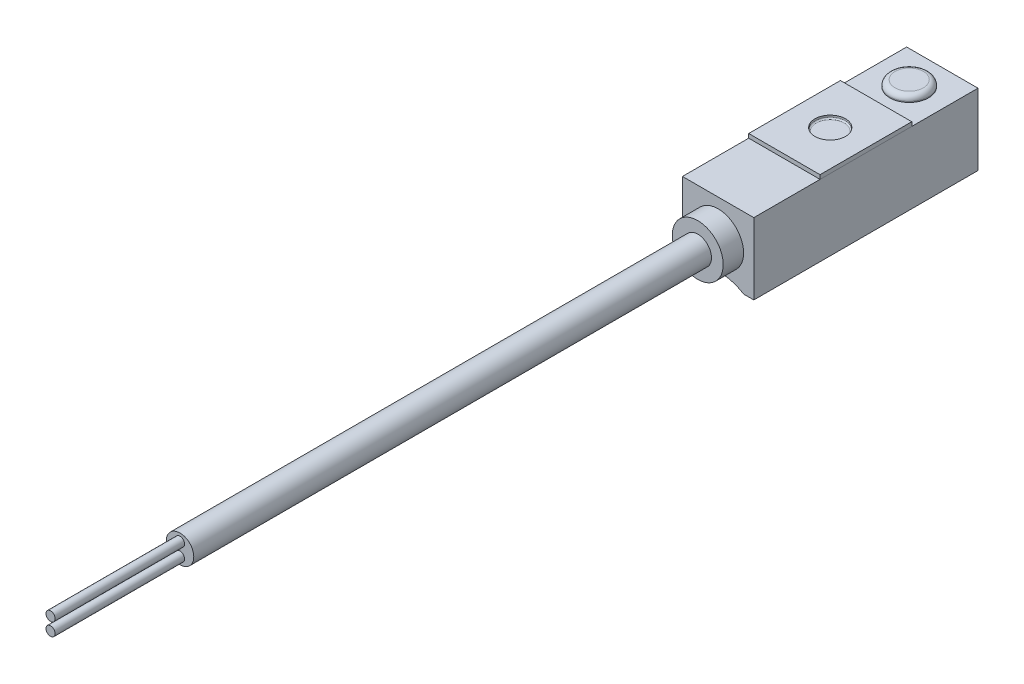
ISO-10303-21;
HEADER;
FILE_DESCRIPTION(('STEP AP214'),'2;1');
FILE_NAME('part.step','',(''),(''),'','','');
FILE_SCHEMA(('AUTOMOTIVE_DESIGN { 1 0 10303 214 1 1 1 1 }'));
ENDSEC;
DATA;
#1=APPLICATION_CONTEXT('core data for automotive mechanical design processes');
#2=APPLICATION_PROTOCOL_DEFINITION('international standard','automotive_design',2000,#1);
#3=PRODUCT_CONTEXT('',#1,'mechanical');
#4=PRODUCT('Part','Part','',(#3));
#5=PRODUCT_RELATED_PRODUCT_CATEGORY('part','',(#4));
#6=PRODUCT_DEFINITION_FORMATION('','',#4);
#7=PRODUCT_DEFINITION_CONTEXT('part definition',#1,'design');
#8=PRODUCT_DEFINITION('design','',#6,#7);
#9=PRODUCT_DEFINITION_SHAPE('','',#8);
#10=(LENGTH_UNIT() NAMED_UNIT(*) SI_UNIT(.MILLI.,.METRE.));
#11=(NAMED_UNIT(*) PLANE_ANGLE_UNIT() SI_UNIT($,.RADIAN.));
#12=(NAMED_UNIT(*) SI_UNIT($,.STERADIAN.) SOLID_ANGLE_UNIT());
#13=UNCERTAINTY_MEASURE_WITH_UNIT(LENGTH_MEASURE(1.E-05),#10,'distance_accuracy_value','');
#14=(GEOMETRIC_REPRESENTATION_CONTEXT(3) GLOBAL_UNCERTAINTY_ASSIGNED_CONTEXT((#13)) GLOBAL_UNIT_ASSIGNED_CONTEXT((#10,
#11,#12)) REPRESENTATION_CONTEXT('',''));
#15=CARTESIAN_POINT('',(0.,0.,0.));
#16=DIRECTION('',(0.,0.,1.));
#17=DIRECTION('',(1.,0.,0.));
#18=AXIS2_PLACEMENT_3D('',#15,#16,#17);
#19=CARTESIAN_POINT('',(-3.5,3.9,6.5));
#20=DIRECTION('',(1.,0.,0.));
#21=DIRECTION('',(0.,0.,-1.));
#22=AXIS2_PLACEMENT_3D('',#19,#20,#21);
#23=PLANE('',#22);
#24=DIRECTION('',(0.,0.,1.));
#25=VECTOR('',#24,1.);
#26=CARTESIAN_POINT('',(-3.5,3.5,6.5));
#27=LINE('',#26,#25);
#28=CARTESIAN_POINT('',(-3.5,3.5,6.5));
#29=VERTEX_POINT('',#28);
#30=CARTESIAN_POINT('',(-3.5,3.5,15.5));
#31=VERTEX_POINT('',#30);
#32=EDGE_CURVE('E114',#29,#31,#27,.T.);
#33=ORIENTED_EDGE('',*,*,#32,.T.);
#34=DIRECTION('',(0.,-1.,0.));
#35=VECTOR('',#34,1.);
#36=CARTESIAN_POINT('',(-3.5,3.9,15.5));
#37=LINE('',#36,#35);
#38=CARTESIAN_POINT('',(-3.5,3.9,15.5));
#39=VERTEX_POINT('',#38);
#40=EDGE_CURVE('E105',#39,#31,#37,.T.);
#41=ORIENTED_EDGE('',*,*,#40,.F.);
#42=DIRECTION('',(0.,0.,1.));
#43=VECTOR('',#42,1.);
#44=CARTESIAN_POINT('',(-3.5,3.9,6.5));
#45=LINE('',#44,#43);
#46=CARTESIAN_POINT('',(-3.5,3.9,6.5));
#47=VERTEX_POINT('',#46);
#48=EDGE_CURVE('E99',#47,#39,#45,.T.);
#49=ORIENTED_EDGE('',*,*,#48,.F.);
#50=DIRECTION('',(0.,-1.,0.));
#51=VECTOR('',#50,1.);
#52=CARTESIAN_POINT('',(-3.5,3.9,6.5));
#53=LINE('',#52,#51);
#54=EDGE_CURVE('E110',#47,#29,#53,.T.);
#55=ORIENTED_EDGE('',*,*,#54,.T.);
#56=EDGE_LOOP('',(#33,#41,#49,#55));
#57=FACE_BOUND('',#56,.T.);
#58=ADVANCED_FACE('F46',(#57),#23,.F.);
#59=CARTESIAN_POINT('',(-3.5,3.9,15.5));
#60=DIRECTION('',(0.,0.,-1.));
#61=DIRECTION('',(-1.,0.,0.));
#62=AXIS2_PLACEMENT_3D('',#59,#60,#61);
#63=PLANE('',#62);
#64=DIRECTION('',(1.,0.,0.));
#65=VECTOR('',#64,1.);
#66=CARTESIAN_POINT('',(-3.5,3.5,15.5));
#67=LINE('',#66,#65);
#68=CARTESIAN_POINT('',(3.5,3.5,15.5));
#69=VERTEX_POINT('',#68);
#70=EDGE_CURVE('E104',#31,#69,#67,.T.);
#71=ORIENTED_EDGE('',*,*,#70,.T.);
#72=DIRECTION('',(0.,-1.,0.));
#73=VECTOR('',#72,1.);
#74=CARTESIAN_POINT('',(3.5,3.9,15.5));
#75=LINE('',#74,#73);
#76=CARTESIAN_POINT('',(3.5,3.9,15.5));
#77=VERTEX_POINT('',#76);
#78=EDGE_CURVE('E102',#77,#69,#75,.T.);
#79=ORIENTED_EDGE('',*,*,#78,.F.);
#80=DIRECTION('',(1.,0.,0.));
#81=VECTOR('',#80,1.);
#82=CARTESIAN_POINT('',(-3.5,3.9,15.5));
#83=LINE('',#82,#81);
#84=EDGE_CURVE('E94',#39,#77,#83,.T.);
#85=ORIENTED_EDGE('',*,*,#84,.F.);
#86=ORIENTED_EDGE('',*,*,#40,.T.);
#87=EDGE_LOOP('',(#71,#79,#85,#86));
#88=FACE_BOUND('',#87,.T.);
#89=ADVANCED_FACE('F103',(#88),#63,.F.);
#90=CARTESIAN_POINT('',(3.5,3.9,6.5));
#91=DIRECTION('',(-1.,0.,0.));
#92=DIRECTION('',(0.,0.,1.));
#93=AXIS2_PLACEMENT_3D('',#90,#91,#92);
#94=PLANE('',#93);
#95=DIRECTION('',(0.,0.,-1.));
#96=VECTOR('',#95,1.);
#97=CARTESIAN_POINT('',(3.5,3.5,6.5));
#98=LINE('',#97,#96);
#99=CARTESIAN_POINT('',(3.5,3.5,6.5));
#100=VERTEX_POINT('',#99);
#101=EDGE_CURVE('E80',#69,#100,#98,.T.);
#102=ORIENTED_EDGE('',*,*,#101,.T.);
#103=DIRECTION('',(0.,-1.,0.));
#104=VECTOR('',#103,1.);
#105=CARTESIAN_POINT('',(3.5,3.9,6.5));
#106=LINE('',#105,#104);
#107=CARTESIAN_POINT('',(3.5,3.9,6.5));
#108=VERTEX_POINT('',#107);
#109=EDGE_CURVE('E106',#108,#100,#106,.T.);
#110=ORIENTED_EDGE('',*,*,#109,.F.);
#111=DIRECTION('',(0.,0.,-1.));
#112=VECTOR('',#111,1.);
#113=CARTESIAN_POINT('',(3.5,3.9,6.5));
#114=LINE('',#113,#112);
#115=EDGE_CURVE('E97',#77,#108,#114,.T.);
#116=ORIENTED_EDGE('',*,*,#115,.F.);
#117=ORIENTED_EDGE('',*,*,#78,.T.);
#118=EDGE_LOOP('',(#102,#110,#116,#117));
#119=FACE_BOUND('',#118,.T.);
#120=ADVANCED_FACE('F108',(#119),#94,.F.);
#121=CARTESIAN_POINT('',(-3.5,3.9,6.5));
#122=DIRECTION('',(0.,0.,1.));
#123=DIRECTION('',(1.,0.,0.));
#124=AXIS2_PLACEMENT_3D('',#121,#122,#123);
#125=PLANE('',#124);
#126=DIRECTION('',(-1.,0.,0.));
#127=VECTOR('',#126,1.);
#128=CARTESIAN_POINT('',(-3.5,3.5,6.5));
#129=LINE('',#128,#127);
#130=EDGE_CURVE('E86',#100,#29,#129,.T.);
#131=ORIENTED_EDGE('',*,*,#130,.T.);
#132=ORIENTED_EDGE('',*,*,#54,.F.);
#133=DIRECTION('',(-1.,0.,0.));
#134=VECTOR('',#133,1.);
#135=CARTESIAN_POINT('',(-3.5,3.9,6.5));
#136=LINE('',#135,#134);
#137=EDGE_CURVE('E63',#108,#47,#136,.T.);
#138=ORIENTED_EDGE('',*,*,#137,.F.);
#139=ORIENTED_EDGE('',*,*,#109,.T.);
#140=EDGE_LOOP('',(#131,#132,#138,#139));
#141=FACE_BOUND('',#140,.T.);
#142=ADVANCED_FACE('F145',(#141),#125,.F.);
#143=CARTESIAN_POINT('',(-3.5,3.9,15.5));
#144=DIRECTION('',(0.,1.,0.));
#145=DIRECTION('',(0.,0.,1.));
#146=AXIS2_PLACEMENT_3D('',#143,#144,#145);
#147=PLANE('',#146);
#148=CARTESIAN_POINT('',(0.,3.9,11.));
#149=DIRECTION('',(0.,1.,0.));
#150=DIRECTION('',(0.,0.,1.));
#151=AXIS2_PLACEMENT_3D('',#148,#149,#150);
#152=CIRCLE('',#151,1.5);
#153=CARTESIAN_POINT('',(0.,3.9,12.5));
#154=VERTEX_POINT('',#153);
#155=EDGE_CURVE('E117',#154,#154,#152,.T.);
#156=ORIENTED_EDGE('',*,*,#155,.F.);
#157=EDGE_LOOP('',(#156));
#158=FACE_BOUND('',#157,.T.);
#159=ORIENTED_EDGE('',*,*,#48,.T.);
#160=ORIENTED_EDGE('',*,*,#84,.T.);
#161=ORIENTED_EDGE('',*,*,#115,.T.);
#162=ORIENTED_EDGE('',*,*,#137,.T.);
#163=EDGE_LOOP('',(#159,#160,#161,#162));
#164=FACE_BOUND('',#163,.T.);
#165=ADVANCED_FACE('F95',(#158,#164),#147,.T.);
#166=CARTESIAN_POINT('',(-3.5,3.5,15.5));
#167=DIRECTION('',(0.,1.,0.));
#168=DIRECTION('',(0.,0.,1.));
#169=AXIS2_PLACEMENT_3D('',#166,#167,#168);
#170=PLANE('',#169);
#171=ORIENTED_EDGE('',*,*,#32,.F.);
#172=ORIENTED_EDGE('',*,*,#130,.F.);
#173=ORIENTED_EDGE('',*,*,#101,.F.);
#174=ORIENTED_EDGE('',*,*,#70,.F.);
#175=EDGE_LOOP('',(#171,#172,#173,#174));
#176=FACE_BOUND('',#175,.T.);
#177=ADVANCED_FACE('F148',(#176),#170,.F.);
#178=CARTESIAN_POINT('',(0.,3.6,11.));
#179=DIRECTION('',(0.,1.,0.));
#180=DIRECTION('',(0.,0.,1.));
#181=AXIS2_PLACEMENT_3D('',#178,#179,#180);
#182=CYLINDRICAL_SURFACE('',#181,1.5);
#183=CARTESIAN_POINT('',(0.,3.727,11.));
#184=DIRECTION('',(0.,1.,0.));
#185=DIRECTION('',(0.,0.,1.));
#186=AXIS2_PLACEMENT_3D('',#183,#184,#185);
#187=CIRCLE('',#186,1.5);
#188=CARTESIAN_POINT('',(0.,3.727,12.5));
#189=VERTEX_POINT('',#188);
#190=EDGE_CURVE('E12',#189,#189,#187,.F.);
#191=ORIENTED_EDGE('',*,*,#190,.T.);
#192=EDGE_LOOP('',(#191));
#193=FACE_BOUND('',#192,.T.);
#194=ORIENTED_EDGE('',*,*,#155,.T.);
#195=EDGE_LOOP('',(#194));
#196=FACE_BOUND('',#195,.T.);
#197=ADVANCED_FACE('F133',(#193,#196),#182,.F.);
#198=CARTESIAN_POINT('',(0.,3.6,11.));
#199=DIRECTION('',(0.,1.,0.));
#200=DIRECTION('',(0.,0.,1.));
#201=AXIS2_PLACEMENT_3D('',#198,#199,#200);
#202=PLANE('',#201);
#203=CARTESIAN_POINT('',(0.,3.6,11.));
#204=DIRECTION('',(0.,1.,0.));
#205=DIRECTION('',(0.,0.,1.));
#206=AXIS2_PLACEMENT_3D('',#203,#204,#205);
#207=CIRCLE('',#206,1.373);
#208=CARTESIAN_POINT('',(0.,3.6,12.373));
#209=VERTEX_POINT('',#208);
#210=EDGE_CURVE('E55',#209,#209,#207,.T.);
#211=ORIENTED_EDGE('',*,*,#210,.T.);
#212=EDGE_LOOP('',(#211));
#213=FACE_BOUND('',#212,.T.);
#214=ADVANCED_FACE('F126',(#213),#202,.T.);
#215=CARTESIAN_POINT('',(0.,3.727,11.));
#216=DIRECTION('',(0.,1.,0.));
#217=DIRECTION('',(0.,0.,1.));
#218=AXIS2_PLACEMENT_3D('',#215,#216,#217);
#219=TOROIDAL_SURFACE('',#218,1.373,0.127);
#220=ORIENTED_EDGE('',*,*,#190,.F.);
#221=EDGE_LOOP('',(#220));
#222=FACE_BOUND('',#221,.T.);
#223=ORIENTED_EDGE('',*,*,#210,.F.);
#224=EDGE_LOOP('',(#223));
#225=FACE_BOUND('',#224,.T.);
#226=ADVANCED_FACE('F48',(#222,#225),#219,.F.);
#227=CLOSED_SHELL('',(#58,#89,#120,#142,#165,#177,#197,#214,#226));
#228=MANIFOLD_SOLID_BREP('B2',#227);
#229=CARTESIAN_POINT('',(0.,0.,74.8));
#230=DIRECTION('',(0.,0.,1.));
#231=DIRECTION('',(1.,0.,0.));
#232=AXIS2_PLACEMENT_3D('',#229,#230,#231);
#233=PLANE('',#232);
#234=CARTESIAN_POINT('',(0.,0.635,74.8));
#235=DIRECTION('',(0.,0.,1.));
#236=DIRECTION('',(1.,0.,0.));
#237=AXIS2_PLACEMENT_3D('',#234,#235,#236);
#238=CIRCLE('',#237,0.45);
#239=CARTESIAN_POINT('',(0.45,0.635,74.8));
#240=VERTEX_POINT('',#239);
#241=EDGE_CURVE('E423',#240,#240,#238,.T.);
#242=ORIENTED_EDGE('',*,*,#241,.F.);
#243=EDGE_LOOP('',(#242));
#244=FACE_BOUND('',#243,.T.);
#245=CARTESIAN_POINT('',(0.,0.,74.8));
#246=DIRECTION('',(0.,0.,1.));
#247=DIRECTION('',(1.,0.,0.));
#248=AXIS2_PLACEMENT_3D('',#245,#246,#247);
#249=CIRCLE('',#248,1.35);
#250=CARTESIAN_POINT('',(1.35,0.,74.8));
#251=VERTEX_POINT('',#250);
#252=EDGE_CURVE('E414',#251,#251,#249,.T.);
#253=ORIENTED_EDGE('',*,*,#252,.T.);
#254=EDGE_LOOP('',(#253));
#255=FACE_BOUND('',#254,.T.);
#256=CARTESIAN_POINT('',(0.,-0.635,74.8));
#257=DIRECTION('',(0.,0.,1.));
#258=DIRECTION('',(1.,0.,0.));
#259=AXIS2_PLACEMENT_3D('',#256,#257,#258);
#260=CIRCLE('',#259,0.45);
#261=CARTESIAN_POINT('',(0.45,-0.635,74.8));
#262=VERTEX_POINT('',#261);
#263=EDGE_CURVE('E429',#262,#262,#260,.T.);
#264=ORIENTED_EDGE('',*,*,#263,.F.);
#265=EDGE_LOOP('',(#264));
#266=FACE_BOUND('',#265,.T.);
#267=ADVANCED_FACE('F232',(#244,#255,#266),#233,.T.);
#268=CARTESIAN_POINT('',(0.,0.,24.));
#269=DIRECTION('',(0.,0.,1.));
#270=DIRECTION('',(1.,0.,0.));
#271=AXIS2_PLACEMENT_3D('',#268,#269,#270);
#272=PLANE('',#271);
#273=CARTESIAN_POINT('',(0.,0.,24.));
#274=DIRECTION('',(0.,0.,1.));
#275=DIRECTION('',(1.,0.,0.));
#276=AXIS2_PLACEMENT_3D('',#273,#274,#275);
#277=CIRCLE('',#276,2.5);
#278=CARTESIAN_POINT('',(2.5,0.,24.));
#279=VERTEX_POINT('',#278);
#280=EDGE_CURVE('E323',#279,#279,#277,.T.);
#281=ORIENTED_EDGE('',*,*,#280,.T.);
#282=EDGE_LOOP('',(#281));
#283=FACE_BOUND('',#282,.T.);
#284=CARTESIAN_POINT('',(0.,0.,24.));
#285=DIRECTION('',(0.,0.,1.));
#286=DIRECTION('',(1.,0.,0.));
#287=AXIS2_PLACEMENT_3D('',#284,#285,#286);
#288=CIRCLE('',#287,1.35);
#289=CARTESIAN_POINT('',(1.35,0.,24.));
#290=VERTEX_POINT('',#289);
#291=EDGE_CURVE('E417',#290,#290,#288,.T.);
#292=ORIENTED_EDGE('',*,*,#291,.F.);
#293=EDGE_LOOP('',(#292));
#294=FACE_BOUND('',#293,.T.);
#295=ADVANCED_FACE('F360',(#283,#294),#272,.T.);
#296=CARTESIAN_POINT('',(-3.5,3.5,22.));
#297=DIRECTION('',(0.,-1.,0.));
#298=DIRECTION('',(0.,0.,-1.));
#299=AXIS2_PLACEMENT_3D('',#296,#297,#298);
#300=PLANE('',#299);
#301=DIRECTION('',(-1.,0.,0.));
#302=VECTOR('',#301,1.);
#303=CARTESIAN_POINT('',(-3.5,3.5,0.));
#304=LINE('',#303,#302);
#305=CARTESIAN_POINT('',(3.5,3.5,0.));
#306=VERTEX_POINT('',#305);
#307=CARTESIAN_POINT('',(-3.5,3.5,0.));
#308=VERTEX_POINT('',#307);
#309=EDGE_CURVE('E278',#306,#308,#304,.T.);
#310=ORIENTED_EDGE('',*,*,#309,.T.);
#311=DIRECTION('',(0.,0.,-1.));
#312=VECTOR('',#311,1.);
#313=CARTESIAN_POINT('',(-3.5,3.5,22.));
#314=LINE('',#313,#312);
#315=CARTESIAN_POINT('',(-3.5,3.5,22.));
#316=VERTEX_POINT('',#315);
#317=EDGE_CURVE('E315',#316,#308,#314,.T.);
#318=ORIENTED_EDGE('',*,*,#317,.F.);
#319=DIRECTION('',(-1.,0.,0.));
#320=VECTOR('',#319,1.);
#321=CARTESIAN_POINT('',(-3.5,3.5,22.));
#322=LINE('',#321,#320);
#323=CARTESIAN_POINT('',(3.5,3.5,22.));
#324=VERTEX_POINT('',#323);
#325=EDGE_CURVE('E249',#324,#316,#322,.T.);
#326=ORIENTED_EDGE('',*,*,#325,.F.);
#327=DIRECTION('',(0.,0.,-1.));
#328=VECTOR('',#327,1.);
#329=CARTESIAN_POINT('',(3.5,3.5,22.));
#330=LINE('',#329,#328);
#331=EDGE_CURVE('E311',#324,#306,#330,.T.);
#332=ORIENTED_EDGE('',*,*,#331,.T.);
#333=EDGE_LOOP('',(#310,#318,#326,#332));
#334=FACE_BOUND('',#333,.T.);
#335=CARTESIAN_POINT('',(0.,3.5,3.25));
#336=DIRECTION('',(0.,-1.,0.));
#337=DIRECTION('',(0.,0.,-1.));
#338=AXIS2_PLACEMENT_3D('',#335,#336,#337);
#339=CIRCLE('',#338,1.9);
#340=CARTESIAN_POINT('',(0.,3.5,1.35));
#341=VERTEX_POINT('',#340);
#342=EDGE_CURVE('E339',#341,#341,#339,.F.);
#343=ORIENTED_EDGE('',*,*,#342,.F.);
#344=EDGE_LOOP('',(#343));
#345=FACE_BOUND('',#344,.T.);
#346=ADVANCED_FACE('F366',(#334,#345),#300,.F.);
#347=CARTESIAN_POINT('',(0.,-7.62,22.));
#348=DIRECTION('',(0.,0.,1.));
#349=DIRECTION('',(1.,0.,0.));
#350=AXIS2_PLACEMENT_3D('',#347,#348,#349);
#351=PLANE('',#350);
#352=DIRECTION('',(0.,-1.,0.));
#353=VECTOR('',#352,1.);
#354=CARTESIAN_POINT('',(-3.5,3.5,22.));
#355=LINE('',#354,#353);
#356=CARTESIAN_POINT('',(-3.5,-3.5,22.));
#357=VERTEX_POINT('',#356);
#358=EDGE_CURVE('E330',#316,#357,#355,.T.);
#359=ORIENTED_EDGE('',*,*,#358,.T.);
#360=DIRECTION('',(1.,0.,0.));
#361=VECTOR('',#360,1.);
#362=CARTESIAN_POINT('',(-3.5,-3.5,22.));
#363=LINE('',#362,#361);
#364=CARTESIAN_POINT('',(-2.51314066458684,-3.5,22.));
#365=VERTEX_POINT('',#364);
#366=EDGE_CURVE('E287',#357,#365,#363,.T.);
#367=ORIENTED_EDGE('',*,*,#366,.T.);
#368=CARTESIAN_POINT('',(0.,-7.62,22.));
#369=DIRECTION('',(0.,0.,-1.));
#370=DIRECTION('',(1.,0.,0.));
#371=AXIS2_PLACEMENT_3D('',#368,#369,#370);
#372=CIRCLE('',#371,4.826);
#373=CARTESIAN_POINT('',(2.51314066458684,-3.5,22.));
#374=VERTEX_POINT('',#373);
#375=EDGE_CURVE('E301',#365,#374,#372,.T.);
#376=ORIENTED_EDGE('',*,*,#375,.T.);
#377=DIRECTION('',(1.,0.,0.));
#378=VECTOR('',#377,1.);
#379=CARTESIAN_POINT('',(2.51314066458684,-3.5,22.));
#380=LINE('',#379,#378);
#381=CARTESIAN_POINT('',(3.5,-3.5,22.));
#382=VERTEX_POINT('',#381);
#383=EDGE_CURVE('E294',#374,#382,#380,.T.);
#384=ORIENTED_EDGE('',*,*,#383,.T.);
#385=DIRECTION('',(0.,1.,0.));
#386=VECTOR('',#385,1.);
#387=CARTESIAN_POINT('',(3.5,3.5,22.));
#388=LINE('',#387,#386);
#389=EDGE_CURVE('E299',#382,#324,#388,.T.);
#390=ORIENTED_EDGE('',*,*,#389,.T.);
#391=ORIENTED_EDGE('',*,*,#325,.T.);
#392=EDGE_LOOP('',(#359,#367,#376,#384,#390,#391));
#393=FACE_BOUND('',#392,.T.);
#394=CARTESIAN_POINT('',(0.,0.,22.));
#395=DIRECTION('',(0.,0.,1.));
#396=DIRECTION('',(1.,0.,0.));
#397=AXIS2_PLACEMENT_3D('',#394,#395,#396);
#398=CIRCLE('',#397,2.5);
#399=CARTESIAN_POINT('',(2.5,0.,22.));
#400=VERTEX_POINT('',#399);
#401=EDGE_CURVE('E411',#400,#400,#398,.T.);
#402=ORIENTED_EDGE('',*,*,#401,.F.);
#403=EDGE_LOOP('',(#402));
#404=FACE_BOUND('',#403,.T.);
#405=ADVANCED_FACE('F296',(#393,#404),#351,.T.);
#406=CARTESIAN_POINT('',(-3.5,3.5,22.));
#407=DIRECTION('',(1.,0.,0.));
#408=DIRECTION('',(0.,1.,0.));
#409=AXIS2_PLACEMENT_3D('',#406,#407,#408);
#410=PLANE('',#409);
#411=DIRECTION('',(0.,-1.,0.));
#412=VECTOR('',#411,1.);
#413=CARTESIAN_POINT('',(-3.5,3.5,0.));
#414=LINE('',#413,#412);
#415=CARTESIAN_POINT('',(-3.5,-3.5,0.));
#416=VERTEX_POINT('',#415);
#417=EDGE_CURVE('E319',#308,#416,#414,.T.);
#418=ORIENTED_EDGE('',*,*,#417,.T.);
#419=DIRECTION('',(0.,0.,-1.));
#420=VECTOR('',#419,1.);
#421=CARTESIAN_POINT('',(-3.5,-3.5,22.));
#422=LINE('',#421,#420);
#423=EDGE_CURVE('E337',#357,#416,#422,.T.);
#424=ORIENTED_EDGE('',*,*,#423,.F.);
#425=ORIENTED_EDGE('',*,*,#358,.F.);
#426=ORIENTED_EDGE('',*,*,#317,.T.);
#427=EDGE_LOOP('',(#418,#424,#425,#426));
#428=FACE_BOUND('',#427,.T.);
#429=ADVANCED_FACE('F384',(#428),#410,.F.);
#430=CARTESIAN_POINT('',(-3.5,-3.5,22.));
#431=DIRECTION('',(0.,1.,0.));
#432=DIRECTION('',(-1.,0.,0.));
#433=AXIS2_PLACEMENT_3D('',#430,#431,#432);
#434=PLANE('',#433);
#435=DIRECTION('',(1.,0.,0.));
#436=VECTOR('',#435,1.);
#437=CARTESIAN_POINT('',(-3.5,-3.5,0.));
#438=LINE('',#437,#436);
#439=CARTESIAN_POINT('',(-2.51314066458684,-3.5,0.));
#440=VERTEX_POINT('',#439);
#441=EDGE_CURVE('E322',#416,#440,#438,.T.);
#442=ORIENTED_EDGE('',*,*,#441,.T.);
#443=DIRECTION('',(0.,0.,-1.));
#444=VECTOR('',#443,1.);
#445=CARTESIAN_POINT('',(-2.51314066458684,-3.5,22.));
#446=LINE('',#445,#444);
#447=EDGE_CURVE('E334',#365,#440,#446,.T.);
#448=ORIENTED_EDGE('',*,*,#447,.F.);
#449=ORIENTED_EDGE('',*,*,#366,.F.);
#450=ORIENTED_EDGE('',*,*,#423,.T.);
#451=EDGE_LOOP('',(#442,#448,#449,#450));
#452=FACE_BOUND('',#451,.T.);
#453=ADVANCED_FACE('F397',(#452),#434,.F.);
#454=CARTESIAN_POINT('',(0.,-7.62,22.));
#455=DIRECTION('',(0.,0.,-1.));
#456=DIRECTION('',(-1.,0.,0.));
#457=AXIS2_PLACEMENT_3D('',#454,#455,#456);
#458=CYLINDRICAL_SURFACE('',#457,4.826);
#459=CARTESIAN_POINT('',(0.,-7.62,0.));
#460=DIRECTION('',(0.,0.,-1.));
#461=DIRECTION('',(1.,0.,0.));
#462=AXIS2_PLACEMENT_3D('',#459,#460,#461);
#463=CIRCLE('',#462,4.826);
#464=CARTESIAN_POINT('',(2.51314066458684,-3.5,0.));
#465=VERTEX_POINT('',#464);
#466=EDGE_CURVE('E325',#440,#465,#463,.T.);
#467=ORIENTED_EDGE('',*,*,#466,.T.);
#468=DIRECTION('',(0.,0.,-1.));
#469=VECTOR('',#468,1.);
#470=CARTESIAN_POINT('',(2.51314066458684,-3.5,22.));
#471=LINE('',#470,#469);
#472=EDGE_CURVE('E310',#374,#465,#471,.T.);
#473=ORIENTED_EDGE('',*,*,#472,.F.);
#474=ORIENTED_EDGE('',*,*,#375,.F.);
#475=ORIENTED_EDGE('',*,*,#447,.T.);
#476=EDGE_LOOP('',(#467,#473,#474,#475));
#477=FACE_BOUND('',#476,.T.);
#478=ADVANCED_FACE('F394',(#477),#458,.F.);
#479=CARTESIAN_POINT('',(2.51314066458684,-3.5,22.));
#480=DIRECTION('',(0.,1.,0.));
#481=DIRECTION('',(-1.,0.,0.));
#482=AXIS2_PLACEMENT_3D('',#479,#480,#481);
#483=PLANE('',#482);
#484=DIRECTION('',(1.,0.,0.));
#485=VECTOR('',#484,1.);
#486=CARTESIAN_POINT('',(2.51314066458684,-3.5,0.));
#487=LINE('',#486,#485);
#488=CARTESIAN_POINT('',(3.5,-3.5,0.));
#489=VERTEX_POINT('',#488);
#490=EDGE_CURVE('E309',#465,#489,#487,.T.);
#491=ORIENTED_EDGE('',*,*,#490,.T.);
#492=DIRECTION('',(0.,0.,-1.));
#493=VECTOR('',#492,1.);
#494=CARTESIAN_POINT('',(3.5,-3.5,22.));
#495=LINE('',#494,#493);
#496=EDGE_CURVE('E306',#382,#489,#495,.T.);
#497=ORIENTED_EDGE('',*,*,#496,.F.);
#498=ORIENTED_EDGE('',*,*,#383,.F.);
#499=ORIENTED_EDGE('',*,*,#472,.T.);
#500=EDGE_LOOP('',(#491,#497,#498,#499));
#501=FACE_BOUND('',#500,.T.);
#502=ADVANCED_FACE('F307',(#501),#483,.F.);
#503=CARTESIAN_POINT('',(3.5,3.5,22.));
#504=DIRECTION('',(-1.,0.,0.));
#505=DIRECTION('',(0.,-1.,0.));
#506=AXIS2_PLACEMENT_3D('',#503,#504,#505);
#507=PLANE('',#506);
#508=DIRECTION('',(0.,1.,0.));
#509=VECTOR('',#508,1.);
#510=CARTESIAN_POINT('',(3.5,3.5,0.));
#511=LINE('',#510,#509);
#512=EDGE_CURVE('E272',#489,#306,#511,.T.);
#513=ORIENTED_EDGE('',*,*,#512,.T.);
#514=ORIENTED_EDGE('',*,*,#331,.F.);
#515=ORIENTED_EDGE('',*,*,#389,.F.);
#516=ORIENTED_EDGE('',*,*,#496,.T.);
#517=EDGE_LOOP('',(#513,#514,#515,#516));
#518=FACE_BOUND('',#517,.T.);
#519=ADVANCED_FACE('F313',(#518),#507,.F.);
#520=CARTESIAN_POINT('',(0.,-7.62,0.));
#521=DIRECTION('',(0.,0.,1.));
#522=DIRECTION('',(1.,0.,0.));
#523=AXIS2_PLACEMENT_3D('',#520,#521,#522);
#524=PLANE('',#523);
#525=ORIENTED_EDGE('',*,*,#417,.F.);
#526=ORIENTED_EDGE('',*,*,#309,.F.);
#527=ORIENTED_EDGE('',*,*,#512,.F.);
#528=ORIENTED_EDGE('',*,*,#490,.F.);
#529=ORIENTED_EDGE('',*,*,#466,.F.);
#530=ORIENTED_EDGE('',*,*,#441,.F.);
#531=EDGE_LOOP('',(#525,#526,#527,#528,#529,#530));
#532=FACE_BOUND('',#531,.T.);
#533=ADVANCED_FACE('F380',(#532),#524,.F.);
#534=CARTESIAN_POINT('',(0.,0.,24.));
#535=DIRECTION('',(0.,0.,-1.));
#536=DIRECTION('',(-1.,0.,0.));
#537=AXIS2_PLACEMENT_3D('',#534,#535,#536);
#538=CYLINDRICAL_SURFACE('',#537,2.5);
#539=ORIENTED_EDGE('',*,*,#280,.F.);
#540=EDGE_LOOP('',(#539));
#541=FACE_BOUND('',#540,.T.);
#542=ORIENTED_EDGE('',*,*,#401,.T.);
#543=EDGE_LOOP('',(#542));
#544=FACE_BOUND('',#543,.T.);
#545=ADVANCED_FACE('F375',(#541,#544),#538,.T.);
#546=CARTESIAN_POINT('',(0.,4.1,3.25));
#547=DIRECTION('',(0.,-1.,0.));
#548=DIRECTION('',(0.,0.,-1.));
#549=AXIS2_PLACEMENT_3D('',#546,#547,#548);
#550=CYLINDRICAL_SURFACE('',#549,1.9);
#551=CARTESIAN_POINT('',(0.,3.592,3.25));
#552=DIRECTION('',(0.,1.,0.));
#553=DIRECTION('',(0.,0.,1.));
#554=AXIS2_PLACEMENT_3D('',#551,#552,#553);
#555=CIRCLE('',#554,1.9);
#556=CARTESIAN_POINT('',(0.,3.592,5.15));
#557=VERTEX_POINT('',#556);
#558=EDGE_CURVE('E44',#557,#557,#555,.F.);
#559=ORIENTED_EDGE('',*,*,#558,.T.);
#560=EDGE_LOOP('',(#559));
#561=FACE_BOUND('',#560,.T.);
#562=ORIENTED_EDGE('',*,*,#342,.T.);
#563=EDGE_LOOP('',(#562));
#564=FACE_BOUND('',#563,.T.);
#565=ADVANCED_FACE('F356',(#561,#564),#550,.T.);
#566=CARTESIAN_POINT('',(0.,4.1,3.25));
#567=DIRECTION('',(0.,1.,0.));
#568=DIRECTION('',(0.,0.,1.));
#569=AXIS2_PLACEMENT_3D('',#566,#567,#568);
#570=PLANE('',#569);
#571=CARTESIAN_POINT('',(0.,4.1,3.25));
#572=DIRECTION('',(0.,1.,0.));
#573=DIRECTION('',(0.,0.,1.));
#574=AXIS2_PLACEMENT_3D('',#571,#572,#573);
#575=CIRCLE('',#574,1.392);
#576=CARTESIAN_POINT('',(0.,4.1,4.642));
#577=VERTEX_POINT('',#576);
#578=EDGE_CURVE('E241',#577,#577,#575,.T.);
#579=ORIENTED_EDGE('',*,*,#578,.T.);
#580=EDGE_LOOP('',(#579));
#581=FACE_BOUND('',#580,.T.);
#582=ADVANCED_FACE('F344',(#581),#570,.T.);
#583=CARTESIAN_POINT('',(0.,3.592,3.25));
#584=DIRECTION('',(0.,1.,0.));
#585=DIRECTION('',(0.,0.,1.));
#586=AXIS2_PLACEMENT_3D('',#583,#584,#585);
#587=TOROIDAL_SURFACE('',#586,1.392,0.508);
#588=ORIENTED_EDGE('',*,*,#558,.F.);
#589=EDGE_LOOP('',(#588));
#590=FACE_BOUND('',#589,.T.);
#591=ORIENTED_EDGE('',*,*,#578,.F.);
#592=EDGE_LOOP('',(#591));
#593=FACE_BOUND('',#592,.T.);
#594=ADVANCED_FACE('F234',(#590,#593),#587,.T.);
#595=CARTESIAN_POINT('',(0.,0.,74.8));
#596=DIRECTION('',(0.,0.,-1.));
#597=DIRECTION('',(-1.,0.,0.));
#598=AXIS2_PLACEMENT_3D('',#595,#596,#597);
#599=CYLINDRICAL_SURFACE('',#598,1.35);
#600=ORIENTED_EDGE('',*,*,#252,.F.);
#601=EDGE_LOOP('',(#600));
#602=FACE_BOUND('',#601,.T.);
#603=ORIENTED_EDGE('',*,*,#291,.T.);
#604=EDGE_LOOP('',(#603));
#605=FACE_BOUND('',#604,.T.);
#606=ADVANCED_FACE('F347',(#602,#605),#599,.T.);
#607=CARTESIAN_POINT('',(0.,0.635,87.5));
#608=DIRECTION('',(0.,0.,-1.));
#609=DIRECTION('',(-1.,0.,0.));
#610=AXIS2_PLACEMENT_3D('',#607,#608,#609);
#611=CYLINDRICAL_SURFACE('',#610,0.45);
#612=CARTESIAN_POINT('',(0.,0.635,87.5));
#613=DIRECTION('',(0.,0.,1.));
#614=DIRECTION('',(1.,0.,0.));
#615=AXIS2_PLACEMENT_3D('',#612,#613,#614);
#616=CIRCLE('',#615,0.45);
#617=CARTESIAN_POINT('',(0.45,0.635,87.5));
#618=VERTEX_POINT('',#617);
#619=EDGE_CURVE('E420',#618,#618,#616,.T.);
#620=ORIENTED_EDGE('',*,*,#619,.F.);
#621=EDGE_LOOP('',(#620));
#622=FACE_BOUND('',#621,.T.);
#623=ORIENTED_EDGE('',*,*,#241,.T.);
#624=EDGE_LOOP('',(#623));
#625=FACE_BOUND('',#624,.T.);
#626=ADVANCED_FACE('F353',(#622,#625),#611,.T.);
#627=CARTESIAN_POINT('',(0.,0.635,87.5));
#628=DIRECTION('',(0.,0.,1.));
#629=DIRECTION('',(1.,0.,0.));
#630=AXIS2_PLACEMENT_3D('',#627,#628,#629);
#631=PLANE('',#630);
#632=ORIENTED_EDGE('',*,*,#619,.T.);
#633=EDGE_LOOP('',(#632));
#634=FACE_BOUND('',#633,.T.);
#635=ADVANCED_FACE('F440',(#634),#631,.T.);
#636=CARTESIAN_POINT('',(0.,-0.635,87.5));
#637=DIRECTION('',(0.,0.,-1.));
#638=DIRECTION('',(-1.,0.,0.));
#639=AXIS2_PLACEMENT_3D('',#636,#637,#638);
#640=CYLINDRICAL_SURFACE('',#639,0.45);
#641=CARTESIAN_POINT('',(0.,-0.635,87.5));
#642=DIRECTION('',(0.,0.,1.));
#643=DIRECTION('',(1.,0.,0.));
#644=AXIS2_PLACEMENT_3D('',#641,#642,#643);
#645=CIRCLE('',#644,0.45);
#646=CARTESIAN_POINT('',(0.45,-0.635,87.5));
#647=VERTEX_POINT('',#646);
#648=EDGE_CURVE('E426',#647,#647,#645,.T.);
#649=ORIENTED_EDGE('',*,*,#648,.F.);
#650=EDGE_LOOP('',(#649));
#651=FACE_BOUND('',#650,.T.);
#652=ORIENTED_EDGE('',*,*,#263,.T.);
#653=EDGE_LOOP('',(#652));
#654=FACE_BOUND('',#653,.T.);
#655=ADVANCED_FACE('F437',(#651,#654),#640,.T.);
#656=CARTESIAN_POINT('',(0.,-0.635,87.5));
#657=DIRECTION('',(0.,0.,1.));
#658=DIRECTION('',(1.,0.,0.));
#659=AXIS2_PLACEMENT_3D('',#656,#657,#658);
#660=PLANE('',#659);
#661=ORIENTED_EDGE('',*,*,#648,.T.);
#662=EDGE_LOOP('',(#661));
#663=FACE_BOUND('',#662,.T.);
#664=ADVANCED_FACE('F435',(#663),#660,.T.);
#665=CLOSED_SHELL('',(#267,#295,#346,#405,#429,#453,#478,#502,#519,#533,#545,#565,#582,#594,
#606,#626,#635,#655,#664));
#666=MANIFOLD_SOLID_BREP('B6',#665);
#667=ADVANCED_BREP_SHAPE_REPRESENTATION('',(#18,#228,#666),#14);
#668=SHAPE_DEFINITION_REPRESENTATION(#9,#667);
ENDSEC;
END-ISO-10303-21;
